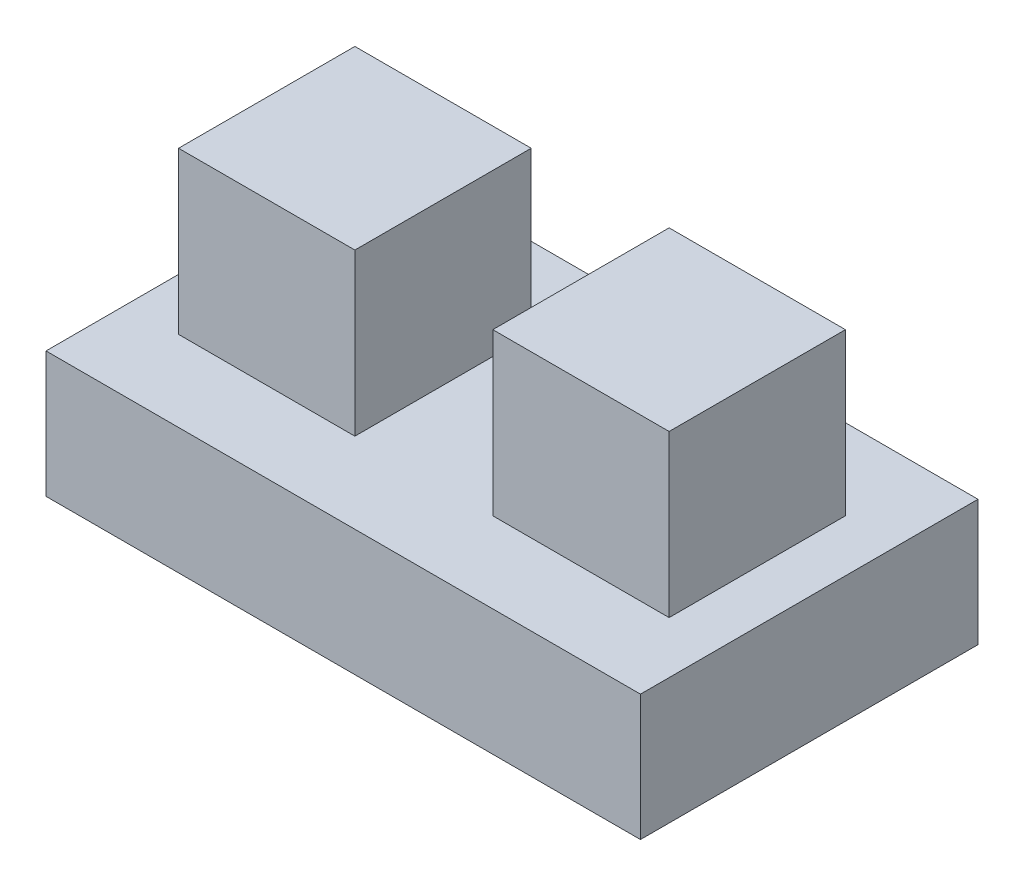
ISO-10303-21;
HEADER;
FILE_DESCRIPTION(('STEP AP214'),'2;1');
FILE_NAME('part.step','',(''),(''),'','','');
FILE_SCHEMA(('AUTOMOTIVE_DESIGN { 1 0 10303 214 1 1 1 1 }'));
ENDSEC;
DATA;
#1=APPLICATION_CONTEXT('core data for automotive mechanical design processes');
#2=APPLICATION_PROTOCOL_DEFINITION('international standard','automotive_design',2000,#1);
#3=PRODUCT_CONTEXT('',#1,'mechanical');
#4=PRODUCT('Part','Part','',(#3));
#5=PRODUCT_RELATED_PRODUCT_CATEGORY('part','',(#4));
#6=PRODUCT_DEFINITION_FORMATION('','',#4);
#7=PRODUCT_DEFINITION_CONTEXT('part definition',#1,'design');
#8=PRODUCT_DEFINITION('design','',#6,#7);
#9=PRODUCT_DEFINITION_SHAPE('','',#8);
#10=(LENGTH_UNIT() NAMED_UNIT(*) SI_UNIT(.MILLI.,.METRE.));
#11=(NAMED_UNIT(*) PLANE_ANGLE_UNIT() SI_UNIT($,.RADIAN.));
#12=(NAMED_UNIT(*) SI_UNIT($,.STERADIAN.) SOLID_ANGLE_UNIT());
#13=UNCERTAINTY_MEASURE_WITH_UNIT(LENGTH_MEASURE(1.E-05),#10,'distance_accuracy_value','');
#14=(GEOMETRIC_REPRESENTATION_CONTEXT(3) GLOBAL_UNCERTAINTY_ASSIGNED_CONTEXT((#13)) GLOBAL_UNIT_ASSIGNED_CONTEXT((#10,
#11,#12)) REPRESENTATION_CONTEXT('',''));
#15=CARTESIAN_POINT('',(0.,0.,0.));
#16=DIRECTION('',(0.,0.,1.));
#17=DIRECTION('',(1.,0.,0.));
#18=AXIS2_PLACEMENT_3D('',#15,#16,#17);
#19=CARTESIAN_POINT('',(0.,25.,0.));
#20=DIRECTION('',(0.,1.,0.));
#21=DIRECTION('',(0.,0.,1.));
#22=AXIS2_PLACEMENT_3D('',#19,#20,#21);
#23=PLANE('',#22);
#24=DIRECTION('',(1.,0.,0.));
#25=VECTOR('',#24,1.);
#26=CARTESIAN_POINT('',(-48.6874452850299,25.,17.5));
#27=LINE('',#26,#25);
#28=CARTESIAN_POINT('',(-48.6874452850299,25.,17.5));
#29=VERTEX_POINT('',#28);
#30=CARTESIAN_POINT('',(-13.6874452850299,25.,17.5));
#31=VERTEX_POINT('',#30);
#32=EDGE_CURVE('E151',#29,#31,#27,.T.);
#33=ORIENTED_EDGE('',*,*,#32,.F.);
#34=DIRECTION('',(0.,0.,1.));
#35=VECTOR('',#34,1.);
#36=CARTESIAN_POINT('',(-48.6874452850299,25.,-17.5));
#37=LINE('',#36,#35);
#38=CARTESIAN_POINT('',(-48.6874452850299,25.,-17.5));
#39=VERTEX_POINT('',#38);
#40=EDGE_CURVE('E148',#39,#29,#37,.T.);
#41=ORIENTED_EDGE('',*,*,#40,.F.);
#42=DIRECTION('',(-1.,0.,0.));
#43=VECTOR('',#42,1.);
#44=CARTESIAN_POINT('',(-48.6874452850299,25.,-17.5));
#45=LINE('',#44,#43);
#46=CARTESIAN_POINT('',(-13.6874452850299,25.,-17.5));
#47=VERTEX_POINT('',#46);
#48=EDGE_CURVE('E160',#47,#39,#45,.T.);
#49=ORIENTED_EDGE('',*,*,#48,.F.);
#50=DIRECTION('',(0.,0.,-1.));
#51=VECTOR('',#50,1.);
#52=CARTESIAN_POINT('',(-13.6874452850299,25.,-17.5));
#53=LINE('',#52,#51);
#54=EDGE_CURVE('E168',#31,#47,#53,.T.);
#55=ORIENTED_EDGE('',*,*,#54,.F.);
#56=EDGE_LOOP('',(#33,#41,#49,#55));
#57=FACE_BOUND('',#56,.T.);
#58=DIRECTION('',(0.,0.,1.));
#59=VECTOR('',#58,1.);
#60=CARTESIAN_POINT('',(-59.,25.,-33.5));
#61=LINE('',#60,#59);
#62=CARTESIAN_POINT('',(-59.,25.,-33.5));
#63=VERTEX_POINT('',#62);
#64=CARTESIAN_POINT('',(-59.,25.,33.5));
#65=VERTEX_POINT('',#64);
#66=EDGE_CURVE('E180',#63,#65,#61,.T.);
#67=ORIENTED_EDGE('',*,*,#66,.T.);
#68=DIRECTION('',(1.,0.,0.));
#69=VECTOR('',#68,1.);
#70=CARTESIAN_POINT('',(-59.,25.,33.5));
#71=LINE('',#70,#69);
#72=CARTESIAN_POINT('',(59.,25.,33.5));
#73=VERTEX_POINT('',#72);
#74=EDGE_CURVE('E183',#65,#73,#71,.T.);
#75=ORIENTED_EDGE('',*,*,#74,.T.);
#76=DIRECTION('',(0.,0.,-1.));
#77=VECTOR('',#76,1.);
#78=CARTESIAN_POINT('',(59.,25.,-33.5));
#79=LINE('',#78,#77);
#80=CARTESIAN_POINT('',(59.,25.,-33.5));
#81=VERTEX_POINT('',#80);
#82=EDGE_CURVE('E186',#73,#81,#79,.T.);
#83=ORIENTED_EDGE('',*,*,#82,.T.);
#84=DIRECTION('',(-1.,0.,0.));
#85=VECTOR('',#84,1.);
#86=CARTESIAN_POINT('',(-59.,25.,-33.5));
#87=LINE('',#86,#85);
#88=EDGE_CURVE('E188',#81,#63,#87,.T.);
#89=ORIENTED_EDGE('',*,*,#88,.T.);
#90=EDGE_LOOP('',(#67,#75,#83,#89));
#91=FACE_BOUND('',#90,.T.);
#92=DIRECTION('',(1.,0.,0.));
#93=VECTOR('',#92,1.);
#94=CARTESIAN_POINT('',(13.6874452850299,25.,17.5));
#95=LINE('',#94,#93);
#96=CARTESIAN_POINT('',(13.6874452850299,25.,17.5));
#97=VERTEX_POINT('',#96);
#98=CARTESIAN_POINT('',(48.6874452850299,25.,17.5));
#99=VERTEX_POINT('',#98);
#100=EDGE_CURVE('E370',#97,#99,#95,.T.);
#101=ORIENTED_EDGE('',*,*,#100,.F.);
#102=DIRECTION('',(0.,0.,1.));
#103=VECTOR('',#102,1.);
#104=CARTESIAN_POINT('',(13.6874452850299,25.,-17.5));
#105=LINE('',#104,#103);
#106=CARTESIAN_POINT('',(13.6874452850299,25.,-17.5));
#107=VERTEX_POINT('',#106);
#108=EDGE_CURVE('E146',#107,#97,#105,.T.);
#109=ORIENTED_EDGE('',*,*,#108,.F.);
#110=DIRECTION('',(-1.,0.,0.));
#111=VECTOR('',#110,1.);
#112=CARTESIAN_POINT('',(13.6874452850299,25.,-17.5));
#113=LINE('',#112,#111);
#114=CARTESIAN_POINT('',(48.6874452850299,25.,-17.5));
#115=VERTEX_POINT('',#114);
#116=EDGE_CURVE('E142',#115,#107,#113,.T.);
#117=ORIENTED_EDGE('',*,*,#116,.F.);
#118=DIRECTION('',(0.,0.,-1.));
#119=VECTOR('',#118,1.);
#120=CARTESIAN_POINT('',(48.6874452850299,25.,-17.5));
#121=LINE('',#120,#119);
#122=EDGE_CURVE('E367',#99,#115,#121,.T.);
#123=ORIENTED_EDGE('',*,*,#122,.F.);
#124=EDGE_LOOP('',(#101,#109,#117,#123));
#125=FACE_BOUND('',#124,.T.);
#126=ADVANCED_FACE('F33',(#57,#91,#125),#23,.T.);
#127=CARTESIAN_POINT('',(-59.,25.,-33.5));
#128=DIRECTION('',(1.,0.,0.));
#129=DIRECTION('',(0.,0.,-1.));
#130=AXIS2_PLACEMENT_3D('',#127,#128,#129);
#131=PLANE('',#130);
#132=DIRECTION('',(0.,0.,1.));
#133=VECTOR('',#132,1.);
#134=CARTESIAN_POINT('',(-59.,0.,-33.5));
#135=LINE('',#134,#133);
#136=CARTESIAN_POINT('',(-59.,0.,-33.5));
#137=VERTEX_POINT('',#136);
#138=CARTESIAN_POINT('',(-59.,0.,33.5));
#139=VERTEX_POINT('',#138);
#140=EDGE_CURVE('E179',#137,#139,#135,.T.);
#141=ORIENTED_EDGE('',*,*,#140,.T.);
#142=DIRECTION('',(0.,-1.,0.));
#143=VECTOR('',#142,1.);
#144=CARTESIAN_POINT('',(-59.,25.,33.5));
#145=LINE('',#144,#143);
#146=EDGE_CURVE('E11',#65,#139,#145,.T.);
#147=ORIENTED_EDGE('',*,*,#146,.F.);
#148=ORIENTED_EDGE('',*,*,#66,.F.);
#149=DIRECTION('',(0.,-1.,0.));
#150=VECTOR('',#149,1.);
#151=CARTESIAN_POINT('',(-59.,25.,-33.5));
#152=LINE('',#151,#150);
#153=EDGE_CURVE('E190',#63,#137,#152,.T.);
#154=ORIENTED_EDGE('',*,*,#153,.T.);
#155=EDGE_LOOP('',(#141,#147,#148,#154));
#156=FACE_BOUND('',#155,.T.);
#157=ADVANCED_FACE('F35',(#156),#131,.F.);
#158=CARTESIAN_POINT('',(-59.,25.,33.5));
#159=DIRECTION('',(0.,0.,-1.));
#160=DIRECTION('',(-1.,0.,0.));
#161=AXIS2_PLACEMENT_3D('',#158,#159,#160);
#162=PLANE('',#161);
#163=DIRECTION('',(1.,0.,0.));
#164=VECTOR('',#163,1.);
#165=CARTESIAN_POINT('',(-59.,0.,33.5));
#166=LINE('',#165,#164);
#167=CARTESIAN_POINT('',(59.,0.,33.5));
#168=VERTEX_POINT('',#167);
#169=EDGE_CURVE('E193',#139,#168,#166,.T.);
#170=ORIENTED_EDGE('',*,*,#169,.T.);
#171=DIRECTION('',(0.,-1.,0.));
#172=VECTOR('',#171,1.);
#173=CARTESIAN_POINT('',(59.,25.,33.5));
#174=LINE('',#173,#172);
#175=EDGE_CURVE('E41',#73,#168,#174,.T.);
#176=ORIENTED_EDGE('',*,*,#175,.F.);
#177=ORIENTED_EDGE('',*,*,#74,.F.);
#178=ORIENTED_EDGE('',*,*,#146,.T.);
#179=EDGE_LOOP('',(#170,#176,#177,#178));
#180=FACE_BOUND('',#179,.T.);
#181=ADVANCED_FACE('F223',(#180),#162,.F.);
#182=CARTESIAN_POINT('',(59.,25.,-33.5));
#183=DIRECTION('',(-1.,0.,0.));
#184=DIRECTION('',(0.,0.,1.));
#185=AXIS2_PLACEMENT_3D('',#182,#183,#184);
#186=PLANE('',#185);
#187=DIRECTION('',(0.,0.,-1.));
#188=VECTOR('',#187,1.);
#189=CARTESIAN_POINT('',(59.,0.,-33.5));
#190=LINE('',#189,#188);
#191=CARTESIAN_POINT('',(59.,0.,-33.5));
#192=VERTEX_POINT('',#191);
#193=EDGE_CURVE('E195',#168,#192,#190,.T.);
#194=ORIENTED_EDGE('',*,*,#193,.T.);
#195=DIRECTION('',(0.,-1.,0.));
#196=VECTOR('',#195,1.);
#197=CARTESIAN_POINT('',(59.,25.,-33.5));
#198=LINE('',#197,#196);
#199=EDGE_CURVE('E200',#81,#192,#198,.T.);
#200=ORIENTED_EDGE('',*,*,#199,.F.);
#201=ORIENTED_EDGE('',*,*,#82,.F.);
#202=ORIENTED_EDGE('',*,*,#175,.T.);
#203=EDGE_LOOP('',(#194,#200,#201,#202));
#204=FACE_BOUND('',#203,.T.);
#205=ADVANCED_FACE('F207',(#204),#186,.F.);
#206=CARTESIAN_POINT('',(-59.,25.,-33.5));
#207=DIRECTION('',(0.,0.,1.));
#208=DIRECTION('',(1.,0.,0.));
#209=AXIS2_PLACEMENT_3D('',#206,#207,#208);
#210=PLANE('',#209);
#211=DIRECTION('',(-1.,0.,0.));
#212=VECTOR('',#211,1.);
#213=CARTESIAN_POINT('',(-59.,0.,-33.5));
#214=LINE('',#213,#212);
#215=EDGE_CURVE('E184',#192,#137,#214,.T.);
#216=ORIENTED_EDGE('',*,*,#215,.T.);
#217=ORIENTED_EDGE('',*,*,#153,.F.);
#218=ORIENTED_EDGE('',*,*,#88,.F.);
#219=ORIENTED_EDGE('',*,*,#199,.T.);
#220=EDGE_LOOP('',(#216,#217,#218,#219));
#221=FACE_BOUND('',#220,.T.);
#222=ADVANCED_FACE('F216',(#221),#210,.F.);
#223=CARTESIAN_POINT('',(0.,0.,0.));
#224=DIRECTION('',(0.,1.,0.));
#225=DIRECTION('',(0.,0.,1.));
#226=AXIS2_PLACEMENT_3D('',#223,#224,#225);
#227=PLANE('',#226);
#228=ORIENTED_EDGE('',*,*,#140,.F.);
#229=ORIENTED_EDGE('',*,*,#215,.F.);
#230=ORIENTED_EDGE('',*,*,#193,.F.);
#231=ORIENTED_EDGE('',*,*,#169,.F.);
#232=EDGE_LOOP('',(#228,#229,#230,#231));
#233=FACE_BOUND('',#232,.T.);
#234=ADVANCED_FACE('F213',(#233),#227,.F.);
#235=CARTESIAN_POINT('',(-48.6874452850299,57.,-17.5));
#236=DIRECTION('',(1.,0.,0.));
#237=DIRECTION('',(0.,0.,-1.));
#238=AXIS2_PLACEMENT_3D('',#235,#236,#237);
#239=PLANE('',#238);
#240=ORIENTED_EDGE('',*,*,#40,.T.);
#241=DIRECTION('',(0.,-1.,0.));
#242=VECTOR('',#241,1.);
#243=CARTESIAN_POINT('',(-48.6874452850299,57.,17.5));
#244=LINE('',#243,#242);
#245=CARTESIAN_POINT('',(-48.6874452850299,57.,17.5));
#246=VERTEX_POINT('',#245);
#247=EDGE_CURVE('E177',#246,#29,#244,.T.);
#248=ORIENTED_EDGE('',*,*,#247,.F.);
#249=DIRECTION('',(0.,0.,1.));
#250=VECTOR('',#249,1.);
#251=CARTESIAN_POINT('',(-48.6874452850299,57.,-17.5));
#252=LINE('',#251,#250);
#253=CARTESIAN_POINT('',(-48.6874452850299,57.,-17.5));
#254=VERTEX_POINT('',#253);
#255=EDGE_CURVE('E156',#254,#246,#252,.T.);
#256=ORIENTED_EDGE('',*,*,#255,.F.);
#257=DIRECTION('',(0.,-1.,0.));
#258=VECTOR('',#257,1.);
#259=CARTESIAN_POINT('',(-48.6874452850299,57.,-17.5));
#260=LINE('',#259,#258);
#261=EDGE_CURVE('E165',#254,#39,#260,.T.);
#262=ORIENTED_EDGE('',*,*,#261,.T.);
#263=EDGE_LOOP('',(#240,#248,#256,#262));
#264=FACE_BOUND('',#263,.T.);
#265=ADVANCED_FACE('F238',(#264),#239,.F.);
#266=CARTESIAN_POINT('',(-48.6874452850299,57.,17.5));
#267=DIRECTION('',(0.,0.,-1.));
#268=DIRECTION('',(-1.,0.,0.));
#269=AXIS2_PLACEMENT_3D('',#266,#267,#268);
#270=PLANE('',#269);
#271=ORIENTED_EDGE('',*,*,#32,.T.);
#272=DIRECTION('',(0.,-1.,0.));
#273=VECTOR('',#272,1.);
#274=CARTESIAN_POINT('',(-13.6874452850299,57.,17.5));
#275=LINE('',#274,#273);
#276=CARTESIAN_POINT('',(-13.6874452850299,57.,17.5));
#277=VERTEX_POINT('',#276);
#278=EDGE_CURVE('E174',#277,#31,#275,.T.);
#279=ORIENTED_EDGE('',*,*,#278,.F.);
#280=DIRECTION('',(1.,0.,0.));
#281=VECTOR('',#280,1.);
#282=CARTESIAN_POINT('',(-48.6874452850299,57.,17.5));
#283=LINE('',#282,#281);
#284=EDGE_CURVE('E159',#246,#277,#283,.T.);
#285=ORIENTED_EDGE('',*,*,#284,.F.);
#286=ORIENTED_EDGE('',*,*,#247,.T.);
#287=EDGE_LOOP('',(#271,#279,#285,#286));
#288=FACE_BOUND('',#287,.T.);
#289=ADVANCED_FACE('F257',(#288),#270,.F.);
#290=CARTESIAN_POINT('',(-13.6874452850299,57.,-17.5));
#291=DIRECTION('',(-1.,0.,0.));
#292=DIRECTION('',(0.,0.,1.));
#293=AXIS2_PLACEMENT_3D('',#290,#291,#292);
#294=PLANE('',#293);
#295=ORIENTED_EDGE('',*,*,#54,.T.);
#296=DIRECTION('',(0.,-1.,0.));
#297=VECTOR('',#296,1.);
#298=CARTESIAN_POINT('',(-13.6874452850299,57.,-17.5));
#299=LINE('',#298,#297);
#300=CARTESIAN_POINT('',(-13.6874452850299,57.,-17.5));
#301=VERTEX_POINT('',#300);
#302=EDGE_CURVE('E56',#301,#47,#299,.T.);
#303=ORIENTED_EDGE('',*,*,#302,.F.);
#304=DIRECTION('',(0.,0.,-1.));
#305=VECTOR('',#304,1.);
#306=CARTESIAN_POINT('',(-13.6874452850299,57.,-17.5));
#307=LINE('',#306,#305);
#308=EDGE_CURVE('E162',#277,#301,#307,.T.);
#309=ORIENTED_EDGE('',*,*,#308,.F.);
#310=ORIENTED_EDGE('',*,*,#278,.T.);
#311=EDGE_LOOP('',(#295,#303,#309,#310));
#312=FACE_BOUND('',#311,.T.);
#313=ADVANCED_FACE('F264',(#312),#294,.F.);
#314=CARTESIAN_POINT('',(-48.6874452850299,57.,-17.5));
#315=DIRECTION('',(0.,0.,1.));
#316=DIRECTION('',(1.,0.,0.));
#317=AXIS2_PLACEMENT_3D('',#314,#315,#316);
#318=PLANE('',#317);
#319=ORIENTED_EDGE('',*,*,#48,.T.);
#320=ORIENTED_EDGE('',*,*,#261,.F.);
#321=DIRECTION('',(-1.,0.,0.));
#322=VECTOR('',#321,1.);
#323=CARTESIAN_POINT('',(-48.6874452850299,57.,-17.5));
#324=LINE('',#323,#322);
#325=EDGE_CURVE('E164',#301,#254,#324,.T.);
#326=ORIENTED_EDGE('',*,*,#325,.F.);
#327=ORIENTED_EDGE('',*,*,#302,.T.);
#328=EDGE_LOOP('',(#319,#320,#326,#327));
#329=FACE_BOUND('',#328,.T.);
#330=ADVANCED_FACE('F271',(#329),#318,.F.);
#331=CARTESIAN_POINT('',(0.,57.,0.));
#332=DIRECTION('',(0.,1.,0.));
#333=DIRECTION('',(0.,0.,1.));
#334=AXIS2_PLACEMENT_3D('',#331,#332,#333);
#335=PLANE('',#334);
#336=ORIENTED_EDGE('',*,*,#255,.T.);
#337=ORIENTED_EDGE('',*,*,#284,.T.);
#338=ORIENTED_EDGE('',*,*,#308,.T.);
#339=ORIENTED_EDGE('',*,*,#325,.T.);
#340=EDGE_LOOP('',(#336,#337,#338,#339));
#341=FACE_BOUND('',#340,.T.);
#342=ADVANCED_FACE('F279',(#341),#335,.T.);
#343=CARTESIAN_POINT('',(13.6874452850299,57.,-17.5));
#344=DIRECTION('',(1.,0.,0.));
#345=DIRECTION('',(0.,0.,-1.));
#346=AXIS2_PLACEMENT_3D('',#343,#344,#345);
#347=PLANE('',#346);
#348=ORIENTED_EDGE('',*,*,#108,.T.);
#349=DIRECTION('',(0.,-1.,0.));
#350=VECTOR('',#349,1.);
#351=CARTESIAN_POINT('',(13.6874452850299,57.,17.5));
#352=LINE('',#351,#350);
#353=CARTESIAN_POINT('',(13.6874452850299,57.,17.5));
#354=VERTEX_POINT('',#353);
#355=EDGE_CURVE('E127',#354,#97,#352,.T.);
#356=ORIENTED_EDGE('',*,*,#355,.F.);
#357=DIRECTION('',(0.,0.,1.));
#358=VECTOR('',#357,1.);
#359=CARTESIAN_POINT('',(13.6874452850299,57.,-17.5));
#360=LINE('',#359,#358);
#361=CARTESIAN_POINT('',(13.6874452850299,57.,-17.5));
#362=VERTEX_POINT('',#361);
#363=EDGE_CURVE('E134',#362,#354,#360,.T.);
#364=ORIENTED_EDGE('',*,*,#363,.F.);
#365=DIRECTION('',(0.,-1.,0.));
#366=VECTOR('',#365,1.);
#367=CARTESIAN_POINT('',(13.6874452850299,57.,-17.5));
#368=LINE('',#367,#366);
#369=EDGE_CURVE('E365',#362,#107,#368,.T.);
#370=ORIENTED_EDGE('',*,*,#369,.T.);
#371=EDGE_LOOP('',(#348,#356,#364,#370));
#372=FACE_BOUND('',#371,.T.);
#373=ADVANCED_FACE('F144',(#372),#347,.F.);
#374=CARTESIAN_POINT('',(13.6874452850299,57.,17.5));
#375=DIRECTION('',(0.,0.,-1.));
#376=DIRECTION('',(-1.,0.,0.));
#377=AXIS2_PLACEMENT_3D('',#374,#375,#376);
#378=PLANE('',#377);
#379=ORIENTED_EDGE('',*,*,#100,.T.);
#380=DIRECTION('',(0.,-1.,0.));
#381=VECTOR('',#380,1.);
#382=CARTESIAN_POINT('',(48.6874452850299,57.,17.5));
#383=LINE('',#382,#381);
#384=CARTESIAN_POINT('',(48.6874452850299,57.,17.5));
#385=VERTEX_POINT('',#384);
#386=EDGE_CURVE('E130',#385,#99,#383,.T.);
#387=ORIENTED_EDGE('',*,*,#386,.F.);
#388=DIRECTION('',(1.,0.,0.));
#389=VECTOR('',#388,1.);
#390=CARTESIAN_POINT('',(13.6874452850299,57.,17.5));
#391=LINE('',#390,#389);
#392=EDGE_CURVE('E123',#354,#385,#391,.T.);
#393=ORIENTED_EDGE('',*,*,#392,.F.);
#394=ORIENTED_EDGE('',*,*,#355,.T.);
#395=EDGE_LOOP('',(#379,#387,#393,#394));
#396=FACE_BOUND('',#395,.T.);
#397=ADVANCED_FACE('F125',(#396),#378,.F.);
#398=CARTESIAN_POINT('',(48.6874452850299,57.,-17.5));
#399=DIRECTION('',(-1.,0.,0.));
#400=DIRECTION('',(0.,0.,1.));
#401=AXIS2_PLACEMENT_3D('',#398,#399,#400);
#402=PLANE('',#401);
#403=ORIENTED_EDGE('',*,*,#122,.T.);
#404=DIRECTION('',(0.,-1.,0.));
#405=VECTOR('',#404,1.);
#406=CARTESIAN_POINT('',(48.6874452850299,57.,-17.5));
#407=LINE('',#406,#405);
#408=CARTESIAN_POINT('',(48.6874452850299,57.,-17.5));
#409=VERTEX_POINT('',#408);
#410=EDGE_CURVE('E48',#409,#115,#407,.T.);
#411=ORIENTED_EDGE('',*,*,#410,.F.);
#412=DIRECTION('',(0.,0.,-1.));
#413=VECTOR('',#412,1.);
#414=CARTESIAN_POINT('',(48.6874452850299,57.,-17.5));
#415=LINE('',#414,#413);
#416=EDGE_CURVE('E133',#385,#409,#415,.T.);
#417=ORIENTED_EDGE('',*,*,#416,.F.);
#418=ORIENTED_EDGE('',*,*,#386,.T.);
#419=EDGE_LOOP('',(#403,#411,#417,#418));
#420=FACE_BOUND('',#419,.T.);
#421=ADVANCED_FACE('F299',(#420),#402,.F.);
#422=CARTESIAN_POINT('',(13.6874452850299,57.,-17.5));
#423=DIRECTION('',(0.,0.,1.));
#424=DIRECTION('',(1.,0.,0.));
#425=AXIS2_PLACEMENT_3D('',#422,#423,#424);
#426=PLANE('',#425);
#427=ORIENTED_EDGE('',*,*,#116,.T.);
#428=ORIENTED_EDGE('',*,*,#369,.F.);
#429=DIRECTION('',(-1.,0.,0.));
#430=VECTOR('',#429,1.);
#431=CARTESIAN_POINT('',(13.6874452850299,57.,-17.5));
#432=LINE('',#431,#430);
#433=EDGE_CURVE('E138',#409,#362,#432,.T.);
#434=ORIENTED_EDGE('',*,*,#433,.F.);
#435=ORIENTED_EDGE('',*,*,#410,.T.);
#436=EDGE_LOOP('',(#427,#428,#434,#435));
#437=FACE_BOUND('',#436,.T.);
#438=ADVANCED_FACE('F306',(#437),#426,.F.);
#439=CARTESIAN_POINT('',(0.,57.,0.));
#440=DIRECTION('',(0.,1.,0.));
#441=DIRECTION('',(0.,0.,1.));
#442=AXIS2_PLACEMENT_3D('',#439,#440,#441);
#443=PLANE('',#442);
#444=ORIENTED_EDGE('',*,*,#363,.T.);
#445=ORIENTED_EDGE('',*,*,#392,.T.);
#446=ORIENTED_EDGE('',*,*,#416,.T.);
#447=ORIENTED_EDGE('',*,*,#433,.T.);
#448=EDGE_LOOP('',(#444,#445,#446,#447));
#449=FACE_BOUND('',#448,.T.);
#450=ADVANCED_FACE('F137',(#449),#443,.T.);
#451=CLOSED_SHELL('',(#126,#157,#181,#205,#222,#234,#265,#289,#313,#330,#342,#373,#397,#421,
#438,#450));
#452=MANIFOLD_SOLID_BREP('B2',#451);
#453=ADVANCED_BREP_SHAPE_REPRESENTATION('',(#18,#452),#14);
#454=SHAPE_DEFINITION_REPRESENTATION(#9,#453);
ENDSEC;
END-ISO-10303-21;
